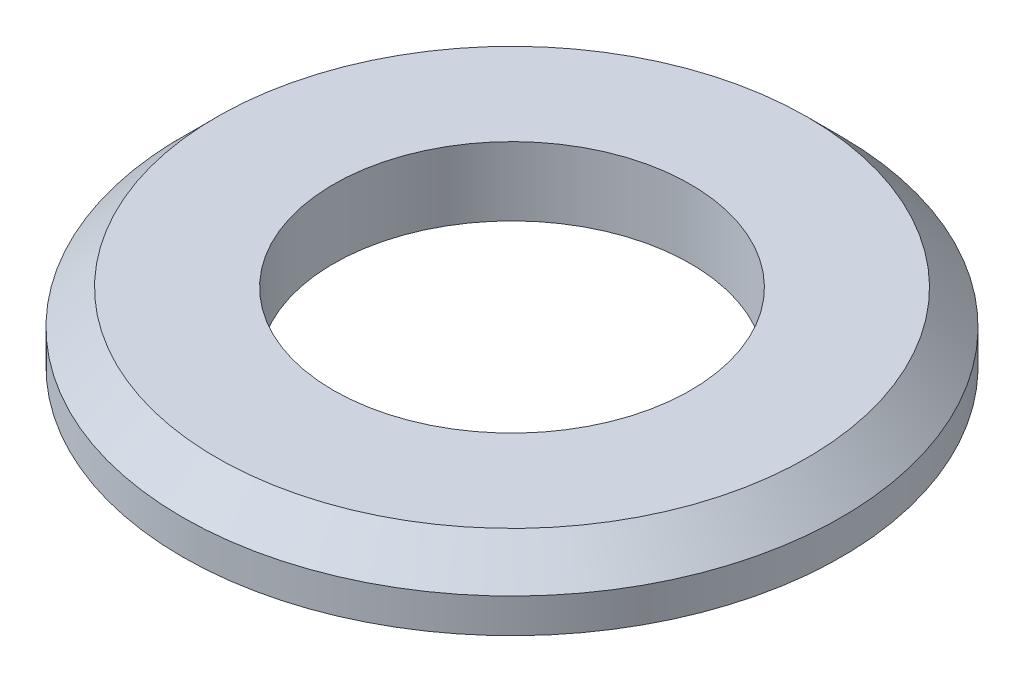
ISO-10303-21;
HEADER;
FILE_DESCRIPTION(('STEP AP214'),'2;1');
FILE_NAME('part.step','',(''),(''),'','','');
FILE_SCHEMA(('AUTOMOTIVE_DESIGN { 1 0 10303 214 1 1 1 1 }'));
ENDSEC;
DATA;
#1=APPLICATION_CONTEXT('core data for automotive mechanical design processes');
#2=APPLICATION_PROTOCOL_DEFINITION('international standard','automotive_design',2000,#1);
#3=PRODUCT_CONTEXT('',#1,'mechanical');
#4=PRODUCT('Part','Part','',(#3));
#5=PRODUCT_RELATED_PRODUCT_CATEGORY('part','',(#4));
#6=PRODUCT_DEFINITION_FORMATION('','',#4);
#7=PRODUCT_DEFINITION_CONTEXT('part definition',#1,'design');
#8=PRODUCT_DEFINITION('design','',#6,#7);
#9=PRODUCT_DEFINITION_SHAPE('','',#8);
#10=(LENGTH_UNIT() NAMED_UNIT(*) SI_UNIT(.MILLI.,.METRE.));
#11=(NAMED_UNIT(*) PLANE_ANGLE_UNIT() SI_UNIT($,.RADIAN.));
#12=(NAMED_UNIT(*) SI_UNIT($,.STERADIAN.) SOLID_ANGLE_UNIT());
#13=UNCERTAINTY_MEASURE_WITH_UNIT(LENGTH_MEASURE(1.E-05),#10,'distance_accuracy_value','');
#14=(GEOMETRIC_REPRESENTATION_CONTEXT(3) GLOBAL_UNCERTAINTY_ASSIGNED_CONTEXT((#13)) GLOBAL_UNIT_ASSIGNED_CONTEXT((#10,
#11,#12)) REPRESENTATION_CONTEXT('',''));
#15=CARTESIAN_POINT('',(0.,0.,0.));
#16=DIRECTION('',(0.,0.,1.));
#17=DIRECTION('',(1.,0.,0.));
#18=AXIS2_PLACEMENT_3D('',#15,#16,#17);
#19=CARTESIAN_POINT('',(0.,2.5,0.));
#20=DIRECTION('',(0.,1.,0.));
#21=DIRECTION('',(0.,0.,1.));
#22=AXIS2_PLACEMENT_3D('',#19,#20,#21);
#23=PLANE('',#22);
#24=CARTESIAN_POINT('',(0.,2.5,0.));
#25=DIRECTION('',(0.,1.,0.));
#26=DIRECTION('',(0.,0.,1.));
#27=AXIS2_PLACEMENT_3D('',#24,#25,#26);
#28=CIRCLE('',#27,10.75);
#29=CARTESIAN_POINT('',(0.,2.5,-10.75));
#30=VERTEX_POINT('',#29);
#31=EDGE_CURVE('E35',#30,#30,#28,.T.);
#32=ORIENTED_EDGE('',*,*,#31,.T.);
#33=EDGE_LOOP('',(#32));
#34=FACE_BOUND('',#33,.T.);
#35=CARTESIAN_POINT('',(0.,2.5,0.));
#36=DIRECTION('',(0.,1.,0.));
#37=DIRECTION('',(0.,0.,1.));
#38=AXIS2_PLACEMENT_3D('',#35,#36,#37);
#39=CIRCLE('',#38,6.5);
#40=CARTESIAN_POINT('',(0.,2.5,6.5));
#41=VERTEX_POINT('',#40);
#42=EDGE_CURVE('E43',#41,#41,#39,.T.);
#43=ORIENTED_EDGE('',*,*,#42,.F.);
#44=EDGE_LOOP('',(#43));
#45=FACE_BOUND('',#44,.T.);
#46=ADVANCED_FACE('F28',(#34,#45),#23,.T.);
#47=CARTESIAN_POINT('',(0.,0.,0.));
#48=DIRECTION('',(0.,1.,0.));
#49=DIRECTION('',(0.,0.,1.));
#50=AXIS2_PLACEMENT_3D('',#47,#48,#49);
#51=PLANE('',#50);
#52=CARTESIAN_POINT('',(0.,0.,0.));
#53=DIRECTION('',(0.,1.,0.));
#54=DIRECTION('',(0.,0.,1.));
#55=AXIS2_PLACEMENT_3D('',#52,#53,#54);
#56=CIRCLE('',#55,12.);
#57=CARTESIAN_POINT('',(0.,0.,12.));
#58=VERTEX_POINT('',#57);
#59=EDGE_CURVE('E39',#58,#58,#56,.T.);
#60=ORIENTED_EDGE('',*,*,#59,.F.);
#61=EDGE_LOOP('',(#60));
#62=FACE_BOUND('',#61,.T.);
#63=CARTESIAN_POINT('',(0.,0.,0.));
#64=DIRECTION('',(0.,1.,0.));
#65=DIRECTION('',(0.,0.,1.));
#66=AXIS2_PLACEMENT_3D('',#63,#64,#65);
#67=CIRCLE('',#66,6.5);
#68=CARTESIAN_POINT('',(0.,0.,6.5));
#69=VERTEX_POINT('',#68);
#70=EDGE_CURVE('E48',#69,#69,#67,.T.);
#71=ORIENTED_EDGE('',*,*,#70,.T.);
#72=EDGE_LOOP('',(#71));
#73=FACE_BOUND('',#72,.T.);
#74=ADVANCED_FACE('F52',(#62,#73),#51,.F.);
#75=CARTESIAN_POINT('',(0.,2.5,0.));
#76=DIRECTION('',(0.,-1.,0.));
#77=DIRECTION('',(0.,0.,-1.));
#78=AXIS2_PLACEMENT_3D('',#75,#76,#77);
#79=CYLINDRICAL_SURFACE('',#78,12.);
#80=CARTESIAN_POINT('',(0.,1.24999999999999,0.));
#81=DIRECTION('',(0.,1.,0.));
#82=DIRECTION('',(0.,0.,1.));
#83=AXIS2_PLACEMENT_3D('',#80,#81,#82);
#84=CIRCLE('',#83,12.);
#85=CARTESIAN_POINT('',(0.,1.24999999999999,-12.));
#86=VERTEX_POINT('',#85);
#87=EDGE_CURVE('E10',#86,#86,#84,.F.);
#88=ORIENTED_EDGE('',*,*,#87,.T.);
#89=EDGE_LOOP('',(#88));
#90=FACE_BOUND('',#89,.T.);
#91=ORIENTED_EDGE('',*,*,#59,.T.);
#92=EDGE_LOOP('',(#91));
#93=FACE_BOUND('',#92,.T.);
#94=ADVANCED_FACE('F30',(#90,#93),#79,.T.);
#95=CARTESIAN_POINT('',(0.,2.5,0.));
#96=DIRECTION('',(0.,-1.,0.));
#97=DIRECTION('',(0.,0.,-1.));
#98=AXIS2_PLACEMENT_3D('',#95,#96,#97);
#99=CYLINDRICAL_SURFACE('',#98,6.5);
#100=ORIENTED_EDGE('',*,*,#42,.T.);
#101=EDGE_LOOP('',(#100));
#102=FACE_BOUND('',#101,.T.);
#103=ORIENTED_EDGE('',*,*,#70,.F.);
#104=EDGE_LOOP('',(#103));
#105=FACE_BOUND('',#104,.T.);
#106=ADVANCED_FACE('F54',(#102,#105),#99,.F.);
#107=CARTESIAN_POINT('',(0.,2.5,0.));
#108=DIRECTION('',(0.,-1.,0.));
#109=DIRECTION('',(0.,0.,-1.));
#110=AXIS2_PLACEMENT_3D('',#107,#108,#109);
#111=CONICAL_SURFACE('',#110,10.75,0.785398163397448);
#112=CARTESIAN_POINT('',(0.,1.24999999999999,-12.));
#113=CARTESIAN_POINT('',(0.,1.26302083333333,-11.9869791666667));
#114=CARTESIAN_POINT('',(0.,1.27604166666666,-11.9739583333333));
#115=CARTESIAN_POINT('',(0.,1.30208333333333,-11.9479166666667));
#116=CARTESIAN_POINT('',(0.,1.31510416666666,-11.9348958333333));
#117=CARTESIAN_POINT('',(0.,1.34114583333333,-11.9088541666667));
#118=CARTESIAN_POINT('',(0.,1.35416666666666,-11.8958333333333));
#119=CARTESIAN_POINT('',(0.,1.38020833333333,-11.8697916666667));
#120=CARTESIAN_POINT('',(0.,1.39322916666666,-11.8567708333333));
#121=CARTESIAN_POINT('',(0.,1.41927083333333,-11.8307291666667));
#122=CARTESIAN_POINT('',(0.,1.43229166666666,-11.8177083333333));
#123=CARTESIAN_POINT('',(0.,1.45833333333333,-11.7916666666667));
#124=CARTESIAN_POINT('',(0.,1.47135416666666,-11.7786458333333));
#125=CARTESIAN_POINT('',(0.,1.49739583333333,-11.7526041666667));
#126=CARTESIAN_POINT('',(0.,1.51041666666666,-11.7395833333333));
#127=CARTESIAN_POINT('',(0.,1.53645833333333,-11.7135416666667));
#128=CARTESIAN_POINT('',(0.,1.54947916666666,-11.7005208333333));
#129=CARTESIAN_POINT('',(0.,1.57552083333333,-11.6744791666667));
#130=CARTESIAN_POINT('',(0.,1.58854166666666,-11.6614583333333));
#131=CARTESIAN_POINT('',(0.,1.61458333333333,-11.6354166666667));
#132=CARTESIAN_POINT('',(0.,1.62760416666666,-11.6223958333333));
#133=CARTESIAN_POINT('',(0.,1.65364583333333,-11.5963541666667));
#134=CARTESIAN_POINT('',(0.,1.66666666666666,-11.5833333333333));
#135=CARTESIAN_POINT('',(0.,1.69270833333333,-11.5572916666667));
#136=CARTESIAN_POINT('',(0.,1.70572916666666,-11.5442708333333));
#137=CARTESIAN_POINT('',(0.,1.73177083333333,-11.5182291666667));
#138=CARTESIAN_POINT('',(0.,1.74479166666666,-11.5052083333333));
#139=CARTESIAN_POINT('',(0.,1.77083333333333,-11.4791666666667));
#140=CARTESIAN_POINT('',(0.,1.78385416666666,-11.4661458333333));
#141=CARTESIAN_POINT('',(0.,1.80989583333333,-11.4401041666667));
#142=CARTESIAN_POINT('',(0.,1.82291666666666,-11.4270833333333));
#143=CARTESIAN_POINT('',(0.,1.84895833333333,-11.4010416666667));
#144=CARTESIAN_POINT('',(0.,1.86197916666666,-11.3880208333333));
#145=CARTESIAN_POINT('',(0.,1.88802083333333,-11.3619791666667));
#146=CARTESIAN_POINT('',(0.,1.90104166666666,-11.3489583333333));
#147=CARTESIAN_POINT('',(0.,1.92708333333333,-11.3229166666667));
#148=CARTESIAN_POINT('',(0.,1.94010416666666,-11.3098958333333));
#149=CARTESIAN_POINT('',(0.,1.96614583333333,-11.2838541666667));
#150=CARTESIAN_POINT('',(0.,1.97916666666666,-11.2708333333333));
#151=CARTESIAN_POINT('',(0.,2.00520833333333,-11.2447916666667));
#152=CARTESIAN_POINT('',(0.,2.01822916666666,-11.2317708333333));
#153=CARTESIAN_POINT('',(0.,2.04427083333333,-11.2057291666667));
#154=CARTESIAN_POINT('',(0.,2.05729166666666,-11.1927083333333));
#155=CARTESIAN_POINT('',(0.,2.08333333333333,-11.1666666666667));
#156=CARTESIAN_POINT('',(0.,2.09635416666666,-11.1536458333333));
#157=CARTESIAN_POINT('',(0.,2.12239583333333,-11.1276041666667));
#158=CARTESIAN_POINT('',(0.,2.13541666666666,-11.1145833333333));
#159=CARTESIAN_POINT('',(0.,2.16145833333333,-11.0885416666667));
#160=CARTESIAN_POINT('',(0.,2.17447916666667,-11.0755208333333));
#161=CARTESIAN_POINT('',(0.,2.20052083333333,-11.0494791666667));
#162=CARTESIAN_POINT('',(0.,2.21354166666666,-11.0364583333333));
#163=CARTESIAN_POINT('',(0.,2.23958333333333,-11.0104166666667));
#164=CARTESIAN_POINT('',(0.,2.25260416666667,-10.9973958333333));
#165=CARTESIAN_POINT('',(0.,2.27864583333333,-10.9713541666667));
#166=CARTESIAN_POINT('',(0.,2.29166666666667,-10.9583333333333));
#167=CARTESIAN_POINT('',(0.,2.31770833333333,-10.9322916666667));
#168=CARTESIAN_POINT('',(0.,2.33072916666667,-10.9192708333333));
#169=CARTESIAN_POINT('',(0.,2.35677083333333,-10.8932291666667));
#170=CARTESIAN_POINT('',(0.,2.36979166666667,-10.8802083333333));
#171=CARTESIAN_POINT('',(0.,2.39583333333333,-10.8541666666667));
#172=CARTESIAN_POINT('',(0.,2.40885416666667,-10.8411458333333));
#173=CARTESIAN_POINT('',(0.,2.43489583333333,-10.8151041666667));
#174=CARTESIAN_POINT('',(0.,2.44791666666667,-10.8020833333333));
#175=CARTESIAN_POINT('',(0.,2.47395833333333,-10.7760416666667));
#176=CARTESIAN_POINT('',(0.,2.48697916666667,-10.7630208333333));
#177=CARTESIAN_POINT('',(0.,2.5,-10.75));
#178=B_SPLINE_CURVE_WITH_KNOTS('',3,(#112,#113,#114,#115,#116,#117,#118,#119,#120,#121,#122,
#123,#124,#125,#126,#127,#128,#129,#130,#131,#132,#133,#134,#135,#136,#137,#138,#139,#140,#141,
#142,#143,#144,#145,#146,#147,#148,#149,#150,#151,#152,#153,#154,#155,#156,#157,#158,#159,#160,
#161,#162,#163,#164,#165,#166,#167,#168,#169,#170,#171,#172,#173,#174,#175,#176,#177),
.UNSPECIFIED.,.F.,.F.,(4,2,2,2,2,2,2,2,2,2,2,2,2,2,2,2,2,2,2,2,2,2,2,2,2,2,2,2,2,2,2,2,4),(0.,
0.0552427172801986,0.110485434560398,0.165728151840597,0.220970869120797,0.276213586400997,
0.331456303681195,0.386699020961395,0.441941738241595,0.497184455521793,0.552427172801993,
0.607669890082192,0.662912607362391,0.71815532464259,0.77339804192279,0.82864075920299,
0.883883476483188,0.939126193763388,0.994368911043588,1.04961162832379,1.10485434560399,
1.16009706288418,1.21533978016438,1.27058249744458,1.32582521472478,1.38106793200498,
1.43631064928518,1.49155336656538,1.54679608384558,1.60203880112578,1.65728151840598,
1.71252423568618,1.76776695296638),.UNSPECIFIED.);
#179=EDGE_CURVE('BSEAM56',#86,#30,#178,.T.);
#180=ORIENTED_EDGE('',*,*,#87,.F.);
#181=ORIENTED_EDGE('',*,*,#31,.F.);
#182=ORIENTED_EDGE('',*,*,#179,.T.);
#183=ORIENTED_EDGE('',*,*,#179,.F.);
#184=EDGE_LOOP('',(#180,#182,#181,#183));
#185=FACE_BOUND('',#184,.T.);
#186=ADVANCED_FACE('F56',(#185),#111,.T.);
#187=CLOSED_SHELL('',(#46,#74,#94,#106,#186));
#188=MANIFOLD_SOLID_BREP('B2',#187);
#189=ADVANCED_BREP_SHAPE_REPRESENTATION('',(#18,#188),#14);
#190=SHAPE_DEFINITION_REPRESENTATION(#9,#189);
ENDSEC;
END-ISO-10303-21;
